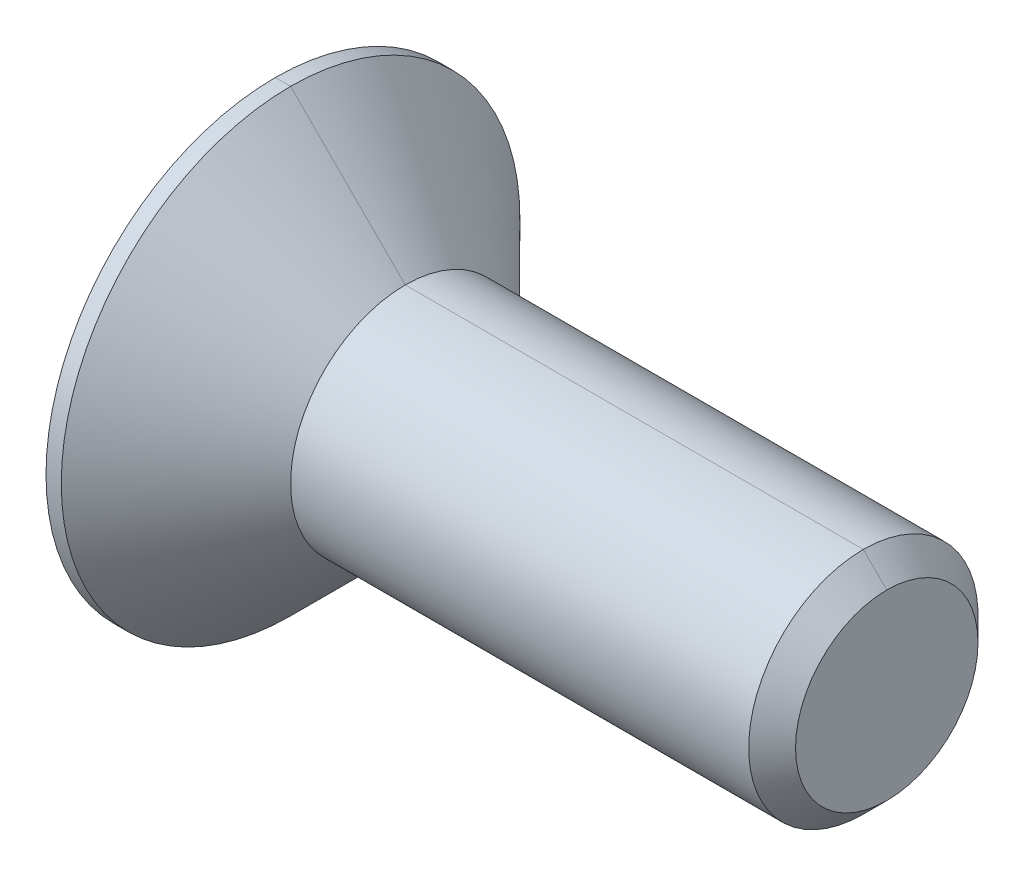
ISO-10303-21;
HEADER;
FILE_DESCRIPTION(('STEP AP214'),'2;1');
FILE_NAME('part.step','',(''),(''),'','','');
FILE_SCHEMA(('AUTOMOTIVE_DESIGN { 1 0 10303 214 1 1 1 1 }'));
ENDSEC;
DATA;
#1=APPLICATION_CONTEXT('core data for automotive mechanical design processes');
#2=APPLICATION_PROTOCOL_DEFINITION('international standard','automotive_design',2000,#1);
#3=PRODUCT_CONTEXT('',#1,'mechanical');
#4=PRODUCT('Part','Part','',(#3));
#5=PRODUCT_RELATED_PRODUCT_CATEGORY('part','',(#4));
#6=PRODUCT_DEFINITION_FORMATION('','',#4);
#7=PRODUCT_DEFINITION_CONTEXT('part definition',#1,'design');
#8=PRODUCT_DEFINITION('design','',#6,#7);
#9=PRODUCT_DEFINITION_SHAPE('','',#8);
#10=(LENGTH_UNIT() NAMED_UNIT(*) SI_UNIT(.MILLI.,.METRE.));
#11=(NAMED_UNIT(*) PLANE_ANGLE_UNIT() SI_UNIT($,.RADIAN.));
#12=(NAMED_UNIT(*) SI_UNIT($,.STERADIAN.) SOLID_ANGLE_UNIT());
#13=UNCERTAINTY_MEASURE_WITH_UNIT(LENGTH_MEASURE(1.E-05),#10,'distance_accuracy_value','');
#14=(GEOMETRIC_REPRESENTATION_CONTEXT(3) GLOBAL_UNCERTAINTY_ASSIGNED_CONTEXT((#13)) GLOBAL_UNIT_ASSIGNED_CONTEXT((#10,
#11,#12)) REPRESENTATION_CONTEXT('',''));
#15=CARTESIAN_POINT('',(0.,0.,0.));
#16=DIRECTION('',(0.,0.,1.));
#17=DIRECTION('',(1.,0.,0.));
#18=AXIS2_PLACEMENT_3D('',#15,#16,#17);
#19=CARTESIAN_POINT('',(1.4829016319,0.,0.));
#20=DIRECTION('',(-1.,0.,0.));
#21=DIRECTION('',(0.,1.,0.));
#22=AXIS2_PLACEMENT_3D('',#19,#20,#21);
#23=CONICAL_SURFACE('',#22,0.5099999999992,1.0471975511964);
#24=DIRECTION('',(0.499999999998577,-0.86602540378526,0.));
#25=VECTOR('',#24,1.);
#26=CARTESIAN_POINT('',(1.199999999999,0.9999999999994,0.));
#27=LINE('',#26,#25);
#28=CARTESIAN_POINT('',(1.199999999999,0.9999999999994,0.));
#29=VERTEX_POINT('',#28);
#30=CARTESIAN_POINT('',(1.777350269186,0.,0.));
#31=VERTEX_POINT('',#30);
#32=EDGE_CURVE('E23',#29,#31,#27,.T.);
#33=ORIENTED_EDGE('',*,*,#32,.F.);
#34=CARTESIAN_POINT('',(1.199999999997,0.,0.));
#35=DIRECTION('',(1.,0.,0.));
#36=DIRECTION('',(0.,0.500000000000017,-0.866025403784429));
#37=AXIS2_PLACEMENT_3D('',#34,#35,#36);
#38=CIRCLE('',#37,0.9999999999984);
#39=CARTESIAN_POINT('',(1.199999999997,0.4999999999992,-0.8660254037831));
#40=VERTEX_POINT('',#39);
#41=EDGE_CURVE('E258',#40,#29,#38,.T.);
#42=ORIENTED_EDGE('',*,*,#41,.F.);
#43=CARTESIAN_POINT('',(1.199999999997,0.,0.));
#44=DIRECTION('',(1.,0.,0.));
#45=DIRECTION('',(0.,-0.500000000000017,-0.866025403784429));
#46=AXIS2_PLACEMENT_3D('',#43,#44,#45);
#47=CIRCLE('',#46,0.9999999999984);
#48=CARTESIAN_POINT('',(1.199999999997,-0.4999999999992,-0.8660254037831));
#49=VERTEX_POINT('',#48);
#50=EDGE_CURVE('E242',#49,#40,#47,.T.);
#51=ORIENTED_EDGE('',*,*,#50,.F.);
#52=CARTESIAN_POINT('',(1.199999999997,0.,0.));
#53=DIRECTION('',(1.,0.,0.));
#54=DIRECTION('',(0.,-1.,0.));
#55=AXIS2_PLACEMENT_3D('',#52,#53,#54);
#56=CIRCLE('',#55,0.9999999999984);
#57=CARTESIAN_POINT('',(1.199999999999,-0.9999999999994,0.));
#58=VERTEX_POINT('',#57);
#59=EDGE_CURVE('E232',#58,#49,#56,.T.);
#60=ORIENTED_EDGE('',*,*,#59,.F.);
#61=DIRECTION('',(-0.499999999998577,-0.86602540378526,0.));
#62=VECTOR('',#61,1.);
#63=CARTESIAN_POINT('',(1.777350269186,0.,0.));
#64=LINE('',#63,#62);
#65=EDGE_CURVE('E10',#31,#58,#64,.T.);
#66=ORIENTED_EDGE('',*,*,#65,.F.);
#67=EDGE_LOOP('',(#33,#42,#51,#60,#66));
#68=FACE_BOUND('',#67,.T.);
#69=ADVANCED_FACE('F15',(#68),#23,.F.);
#70=CARTESIAN_POINT('',(1.4829016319,0.,0.));
#71=DIRECTION('',(-1.,0.,0.));
#72=DIRECTION('',(0.,1.,0.));
#73=AXIS2_PLACEMENT_3D('',#70,#71,#72);
#74=CONICAL_SURFACE('',#73,0.5099999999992,1.0471975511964);
#75=CARTESIAN_POINT('',(1.199999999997,0.,0.));
#76=DIRECTION('',(1.,0.,0.));
#77=DIRECTION('',(0.,-0.500000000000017,0.866025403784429));
#78=AXIS2_PLACEMENT_3D('',#75,#76,#77);
#79=CIRCLE('',#78,0.9999999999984);
#80=CARTESIAN_POINT('',(1.199999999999,-0.4999999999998,0.8660254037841));
#81=VERTEX_POINT('',#80);
#82=EDGE_CURVE('E166',#81,#58,#79,.T.);
#83=ORIENTED_EDGE('',*,*,#82,.F.);
#84=CARTESIAN_POINT('',(1.199999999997,0.,0.));
#85=DIRECTION('',(1.,0.,0.));
#86=DIRECTION('',(0.,0.500000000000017,0.866025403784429));
#87=AXIS2_PLACEMENT_3D('',#84,#85,#86);
#88=CIRCLE('',#87,0.9999999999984);
#89=CARTESIAN_POINT('',(1.199999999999,0.4999999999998,0.8660254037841));
#90=VERTEX_POINT('',#89);
#91=EDGE_CURVE('E216',#90,#81,#88,.T.);
#92=ORIENTED_EDGE('',*,*,#91,.F.);
#93=CARTESIAN_POINT('',(1.199999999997,0.,0.));
#94=DIRECTION('',(1.,0.,0.));
#95=DIRECTION('',(0.,1.,0.));
#96=AXIS2_PLACEMENT_3D('',#93,#94,#95);
#97=CIRCLE('',#96,0.9999999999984);
#98=EDGE_CURVE('E257',#29,#90,#97,.T.);
#99=ORIENTED_EDGE('',*,*,#98,.F.);
#100=ORIENTED_EDGE('',*,*,#32,.T.);
#101=ORIENTED_EDGE('',*,*,#65,.T.);
#102=EDGE_LOOP('',(#83,#92,#99,#100,#101));
#103=FACE_BOUND('',#102,.T.);
#104=ADVANCED_FACE('F404',(#103),#74,.F.);
#105=CARTESIAN_POINT('',(1.2,0.,0.));
#106=DIRECTION('',(-1.,0.,0.));
#107=DIRECTION('',(0.,0.,1.));
#108=AXIS2_PLACEMENT_3D('',#105,#106,#107);
#109=PLANE('',#108);
#110=DIRECTION('',(1.17608397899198E-12,0.866025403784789,-0.499999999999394));
#111=VECTOR('',#110,1.);
#112=CARTESIAN_POINT('',(1.199999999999,0.4999999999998,0.8660254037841));
#113=LINE('',#112,#111);
#114=CARTESIAN_POINT('',(1.2,1.,0.5773502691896));
#115=VERTEX_POINT('',#114);
#116=EDGE_CURVE('E208',#90,#115,#113,.T.);
#117=ORIENTED_EDGE('',*,*,#116,.T.);
#118=DIRECTION('',(1.881426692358E-12,1.085704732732E-12,1.));
#119=VECTOR('',#118,1.);
#120=CARTESIAN_POINT('',(1.199999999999,0.9999999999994,0.));
#121=LINE('',#120,#119);
#122=EDGE_CURVE('E255',#29,#115,#121,.T.);
#123=ORIENTED_EDGE('',*,*,#122,.F.);
#124=ORIENTED_EDGE('',*,*,#98,.T.);
#125=EDGE_LOOP('',(#117,#123,#124));
#126=FACE_BOUND('',#125,.T.);
#127=ADVANCED_FACE('F408',(#126),#109,.T.);
#128=CARTESIAN_POINT('',(1.2,1.,0.5773502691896));
#129=DIRECTION('',(0.,1.,0.));
#130=DIRECTION('',(1.,0.,0.));
#131=AXIS2_PLACEMENT_3D('',#128,#129,#130);
#132=PLANE('',#131);
#133=DIRECTION('',(1.,0.,0.));
#134=VECTOR('',#133,1.);
#135=CARTESIAN_POINT('',(0.,1.,0.5773502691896));
#136=LINE('',#135,#134);
#137=CARTESIAN_POINT('',(0.,1.,0.5773502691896));
#138=VERTEX_POINT('',#137);
#139=EDGE_CURVE('E201',#138,#115,#136,.T.);
#140=ORIENTED_EDGE('',*,*,#139,.F.);
#141=DIRECTION('',(0.,0.,-1.));
#142=VECTOR('',#141,1.);
#143=CARTESIAN_POINT('',(0.,1.,0.5773502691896));
#144=LINE('',#143,#142);
#145=CARTESIAN_POINT('',(0.,1.,-0.5773502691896));
#146=VERTEX_POINT('',#145);
#147=EDGE_CURVE('E274',#138,#146,#144,.T.);
#148=ORIENTED_EDGE('',*,*,#147,.T.);
#149=DIRECTION('',(1.,0.,0.));
#150=VECTOR('',#149,1.);
#151=CARTESIAN_POINT('',(0.,1.,-0.5773502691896));
#152=LINE('',#151,#150);
#153=CARTESIAN_POINT('',(1.2,1.,-0.5773502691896));
#154=VERTEX_POINT('',#153);
#155=EDGE_CURVE('E247',#146,#154,#152,.T.);
#156=ORIENTED_EDGE('',*,*,#155,.T.);
#157=DIRECTION('',(-1.881426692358E-12,-1.086089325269E-12,1.));
#158=VECTOR('',#157,1.);
#159=CARTESIAN_POINT('',(1.2,1.,-0.5773502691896));
#160=LINE('',#159,#158);
#161=EDGE_CURVE('E254',#154,#29,#160,.T.);
#162=ORIENTED_EDGE('',*,*,#161,.T.);
#163=ORIENTED_EDGE('',*,*,#122,.T.);
#164=EDGE_LOOP('',(#140,#148,#156,#162,#163));
#165=FACE_BOUND('',#164,.T.);
#166=ADVANCED_FACE('F414',(#165),#132,.F.);
#167=CARTESIAN_POINT('',(1.2,0.,0.));
#168=DIRECTION('',(-1.,0.,0.));
#169=DIRECTION('',(0.,0.,1.));
#170=AXIS2_PLACEMENT_3D('',#167,#168,#169);
#171=PLANE('',#170);
#172=ORIENTED_EDGE('',*,*,#161,.F.);
#173=DIRECTION('',(-1.17569938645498E-12,-0.866025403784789,-0.499999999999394));
#174=VECTOR('',#173,1.);
#175=CARTESIAN_POINT('',(1.2,1.,-0.5773502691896));
#176=LINE('',#175,#174);
#177=EDGE_CURVE('E251',#154,#40,#176,.T.);
#178=ORIENTED_EDGE('',*,*,#177,.T.);
#179=ORIENTED_EDGE('',*,*,#41,.T.);
#180=EDGE_LOOP('',(#172,#178,#179));
#181=FACE_BOUND('',#180,.T.);
#182=ADVANCED_FACE('F624',(#181),#171,.T.);
#183=CARTESIAN_POINT('',(1.2,1.,-0.5773502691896));
#184=DIRECTION('',(0.,0.500000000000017,-0.866025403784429));
#185=DIRECTION('',(-1.,0.,0.));
#186=AXIS2_PLACEMENT_3D('',#183,#184,#185);
#187=PLANE('',#186);
#188=ORIENTED_EDGE('',*,*,#155,.F.);
#189=DIRECTION('',(0.,0.866025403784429,0.500000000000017));
#190=VECTOR('',#189,1.);
#191=CARTESIAN_POINT('',(0.,0.,-1.154700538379));
#192=LINE('',#191,#190);
#193=CARTESIAN_POINT('',(0.,0.,-1.154700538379));
#194=VERTEX_POINT('',#193);
#195=EDGE_CURVE('E178',#194,#146,#192,.T.);
#196=ORIENTED_EDGE('',*,*,#195,.F.);
#197=DIRECTION('',(1.,0.,0.));
#198=VECTOR('',#197,1.);
#199=CARTESIAN_POINT('',(0.,0.,-1.154700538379));
#200=LINE('',#199,#198);
#201=CARTESIAN_POINT('',(1.2,0.,-1.154700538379));
#202=VERTEX_POINT('',#201);
#203=EDGE_CURVE('E173',#194,#202,#200,.T.);
#204=ORIENTED_EDGE('',*,*,#203,.T.);
#205=DIRECTION('',(1.17608397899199E-12,-0.866025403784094,-0.500000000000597));
#206=VECTOR('',#205,1.);
#207=CARTESIAN_POINT('',(1.199999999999,0.4999999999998,-0.8660254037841));
#208=LINE('',#207,#206);
#209=EDGE_CURVE('E246',#40,#202,#208,.T.);
#210=ORIENTED_EDGE('',*,*,#209,.F.);
#211=ORIENTED_EDGE('',*,*,#177,.F.);
#212=EDGE_LOOP('',(#188,#196,#204,#210,#211));
#213=FACE_BOUND('',#212,.T.);
#214=ADVANCED_FACE('F612',(#213),#187,.F.);
#215=CARTESIAN_POINT('',(1.2,0.,0.));
#216=DIRECTION('',(-1.,0.,0.));
#217=DIRECTION('',(0.,0.,1.));
#218=AXIS2_PLACEMENT_3D('',#215,#216,#217);
#219=PLANE('',#218);
#220=ORIENTED_EDGE('',*,*,#50,.T.);
#221=ORIENTED_EDGE('',*,*,#209,.T.);
#222=DIRECTION('',(-1.17569938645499E-12,-0.866025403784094,0.500000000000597));
#223=VECTOR('',#222,1.);
#224=CARTESIAN_POINT('',(1.2,0.,-1.154700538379));
#225=LINE('',#224,#223);
#226=EDGE_CURVE('E238',#202,#49,#225,.T.);
#227=ORIENTED_EDGE('',*,*,#226,.T.);
#228=EDGE_LOOP('',(#220,#221,#227));
#229=FACE_BOUND('',#228,.T.);
#230=ADVANCED_FACE('F601',(#229),#219,.T.);
#231=CARTESIAN_POINT('',(1.2,0.,-1.154700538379));
#232=DIRECTION('',(0.,-0.500000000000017,-0.866025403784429));
#233=DIRECTION('',(0.,-0.866025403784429,0.500000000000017));
#234=AXIS2_PLACEMENT_3D('',#231,#232,#233);
#235=PLANE('',#234);
#236=ORIENTED_EDGE('',*,*,#203,.F.);
#237=DIRECTION('',(0.,0.866025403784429,-0.500000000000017));
#238=VECTOR('',#237,1.);
#239=CARTESIAN_POINT('',(0.,-1.,-0.5773502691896));
#240=LINE('',#239,#238);
#241=CARTESIAN_POINT('',(0.,-1.,-0.5773502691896));
#242=VERTEX_POINT('',#241);
#243=EDGE_CURVE('E169',#242,#194,#240,.T.);
#244=ORIENTED_EDGE('',*,*,#243,.F.);
#245=DIRECTION('',(1.,0.,0.));
#246=VECTOR('',#245,1.);
#247=CARTESIAN_POINT('',(0.,-1.,-0.5773502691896));
#248=LINE('',#247,#246);
#249=CARTESIAN_POINT('',(1.2,-1.,-0.5773502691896));
#250=VERTEX_POINT('',#249);
#251=EDGE_CURVE('E153',#242,#250,#248,.T.);
#252=ORIENTED_EDGE('',*,*,#251,.T.);
#253=DIRECTION('',(1.17608397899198E-12,-0.866025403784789,0.499999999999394));
#254=VECTOR('',#253,1.);
#255=CARTESIAN_POINT('',(1.199999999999,-0.4999999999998,-0.8660254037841));
#256=LINE('',#255,#254);
#257=EDGE_CURVE('E204',#49,#250,#256,.T.);
#258=ORIENTED_EDGE('',*,*,#257,.F.);
#259=ORIENTED_EDGE('',*,*,#226,.F.);
#260=EDGE_LOOP('',(#236,#244,#252,#258,#259));
#261=FACE_BOUND('',#260,.T.);
#262=ADVANCED_FACE('F170',(#261),#235,.F.);
#263=CARTESIAN_POINT('',(1.2,0.,0.));
#264=DIRECTION('',(-1.,0.,0.));
#265=DIRECTION('',(0.,0.,1.));
#266=AXIS2_PLACEMENT_3D('',#263,#264,#265);
#267=PLANE('',#266);
#268=ORIENTED_EDGE('',*,*,#257,.T.);
#269=DIRECTION('',(1.881426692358E-12,-1.085704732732E-12,-1.));
#270=VECTOR('',#269,1.);
#271=CARTESIAN_POINT('',(1.199999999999,-0.9999999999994,0.));
#272=LINE('',#271,#270);
#273=EDGE_CURVE('E162',#58,#250,#272,.T.);
#274=ORIENTED_EDGE('',*,*,#273,.F.);
#275=ORIENTED_EDGE('',*,*,#59,.T.);
#276=EDGE_LOOP('',(#268,#274,#275));
#277=FACE_BOUND('',#276,.T.);
#278=ADVANCED_FACE('F427',(#277),#267,.T.);
#279=CARTESIAN_POINT('',(1.2,-1.,-0.5773502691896));
#280=DIRECTION('',(0.,-1.,0.));
#281=DIRECTION('',(0.,0.,-1.));
#282=AXIS2_PLACEMENT_3D('',#279,#280,#281);
#283=PLANE('',#282);
#284=ORIENTED_EDGE('',*,*,#251,.F.);
#285=DIRECTION('',(0.,0.,1.));
#286=VECTOR('',#285,1.);
#287=CARTESIAN_POINT('',(0.,-1.,-0.5773502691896));
#288=LINE('',#287,#286);
#289=CARTESIAN_POINT('',(0.,-1.,0.5773502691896));
#290=VERTEX_POINT('',#289);
#291=EDGE_CURVE('E158',#242,#290,#288,.T.);
#292=ORIENTED_EDGE('',*,*,#291,.T.);
#293=DIRECTION('',(1.,0.,0.));
#294=VECTOR('',#293,1.);
#295=CARTESIAN_POINT('',(0.,-1.,0.5773502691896));
#296=LINE('',#295,#294);
#297=CARTESIAN_POINT('',(1.2,-1.,0.5773502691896));
#298=VERTEX_POINT('',#297);
#299=EDGE_CURVE('E220',#290,#298,#296,.T.);
#300=ORIENTED_EDGE('',*,*,#299,.T.);
#301=DIRECTION('',(-1.881426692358E-12,1.086089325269E-12,-1.));
#302=VECTOR('',#301,1.);
#303=CARTESIAN_POINT('',(1.2,-1.,0.5773502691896));
#304=LINE('',#303,#302);
#305=EDGE_CURVE('E227',#298,#58,#304,.T.);
#306=ORIENTED_EDGE('',*,*,#305,.T.);
#307=ORIENTED_EDGE('',*,*,#273,.T.);
#308=EDGE_LOOP('',(#284,#292,#300,#306,#307));
#309=FACE_BOUND('',#308,.T.);
#310=ADVANCED_FACE('F155',(#309),#283,.F.);
#311=CARTESIAN_POINT('',(1.2,0.,0.));
#312=DIRECTION('',(-1.,0.,0.));
#313=DIRECTION('',(0.,0.,1.));
#314=AXIS2_PLACEMENT_3D('',#311,#312,#313);
#315=PLANE('',#314);
#316=ORIENTED_EDGE('',*,*,#305,.F.);
#317=DIRECTION('',(-1.17569938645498E-12,0.866025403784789,0.499999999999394));
#318=VECTOR('',#317,1.);
#319=CARTESIAN_POINT('',(1.2,-1.,0.5773502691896));
#320=LINE('',#319,#318);
#321=EDGE_CURVE('E223',#298,#81,#320,.T.);
#322=ORIENTED_EDGE('',*,*,#321,.T.);
#323=ORIENTED_EDGE('',*,*,#82,.T.);
#324=EDGE_LOOP('',(#316,#322,#323));
#325=FACE_BOUND('',#324,.T.);
#326=ADVANCED_FACE('F426',(#325),#315,.T.);
#327=CARTESIAN_POINT('',(1.2,-1.,0.5773502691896));
#328=DIRECTION('',(0.,-0.500000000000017,0.866025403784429));
#329=DIRECTION('',(-1.,0.,0.));
#330=AXIS2_PLACEMENT_3D('',#327,#328,#329);
#331=PLANE('',#330);
#332=ORIENTED_EDGE('',*,*,#299,.F.);
#333=DIRECTION('',(0.,-0.866025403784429,-0.500000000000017));
#334=VECTOR('',#333,1.);
#335=CARTESIAN_POINT('',(0.,0.,1.154700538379));
#336=LINE('',#335,#334);
#337=CARTESIAN_POINT('',(0.,0.,1.154700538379));
#338=VERTEX_POINT('',#337);
#339=EDGE_CURVE('E185',#338,#290,#336,.T.);
#340=ORIENTED_EDGE('',*,*,#339,.F.);
#341=DIRECTION('',(1.,0.,0.));
#342=VECTOR('',#341,1.);
#343=CARTESIAN_POINT('',(0.,0.,1.154700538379));
#344=LINE('',#343,#342);
#345=CARTESIAN_POINT('',(1.2,0.,1.154700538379));
#346=VERTEX_POINT('',#345);
#347=EDGE_CURVE('E197',#338,#346,#344,.T.);
#348=ORIENTED_EDGE('',*,*,#347,.T.);
#349=DIRECTION('',(1.17608397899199E-12,0.866025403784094,0.500000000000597));
#350=VECTOR('',#349,1.);
#351=CARTESIAN_POINT('',(1.199999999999,-0.4999999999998,0.8660254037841));
#352=LINE('',#351,#350);
#353=EDGE_CURVE('E213',#81,#346,#352,.T.);
#354=ORIENTED_EDGE('',*,*,#353,.F.);
#355=ORIENTED_EDGE('',*,*,#321,.F.);
#356=EDGE_LOOP('',(#332,#340,#348,#354,#355));
#357=FACE_BOUND('',#356,.T.);
#358=ADVANCED_FACE('F432',(#357),#331,.F.);
#359=CARTESIAN_POINT('',(1.2,0.,0.));
#360=DIRECTION('',(-1.,0.,0.));
#361=DIRECTION('',(0.,0.,1.));
#362=AXIS2_PLACEMENT_3D('',#359,#360,#361);
#363=PLANE('',#362);
#364=ORIENTED_EDGE('',*,*,#353,.T.);
#365=DIRECTION('',(-1.17569938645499E-12,0.866025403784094,-0.500000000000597));
#366=VECTOR('',#365,1.);
#367=CARTESIAN_POINT('',(1.2,0.,1.154700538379));
#368=LINE('',#367,#366);
#369=EDGE_CURVE('E212',#346,#90,#368,.T.);
#370=ORIENTED_EDGE('',*,*,#369,.T.);
#371=ORIENTED_EDGE('',*,*,#91,.T.);
#372=EDGE_LOOP('',(#364,#370,#371));
#373=FACE_BOUND('',#372,.T.);
#374=ADVANCED_FACE('F398',(#373),#363,.T.);
#375=CARTESIAN_POINT('',(1.2,0.,1.154700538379));
#376=DIRECTION('',(0.,0.500000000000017,0.866025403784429));
#377=DIRECTION('',(1.,0.,0.));
#378=AXIS2_PLACEMENT_3D('',#375,#376,#377);
#379=PLANE('',#378);
#380=ORIENTED_EDGE('',*,*,#347,.F.);
#381=DIRECTION('',(0.,-0.866025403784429,0.500000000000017));
#382=VECTOR('',#381,1.);
#383=CARTESIAN_POINT('',(0.,1.,0.5773502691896));
#384=LINE('',#383,#382);
#385=EDGE_CURVE('E191',#138,#338,#384,.T.);
#386=ORIENTED_EDGE('',*,*,#385,.F.);
#387=ORIENTED_EDGE('',*,*,#139,.T.);
#388=ORIENTED_EDGE('',*,*,#116,.F.);
#389=ORIENTED_EDGE('',*,*,#369,.F.);
#390=EDGE_LOOP('',(#380,#386,#387,#388,#389));
#391=FACE_BOUND('',#390,.T.);
#392=ADVANCED_FACE('F390',(#391),#379,.F.);
#393=CARTESIAN_POINT('',(0.,0.,-1.));
#394=DIRECTION('',(1.,0.,0.));
#395=DIRECTION('',(0.,1.,0.));
#396=AXIS2_PLACEMENT_3D('',#393,#394,#395);
#397=PLANE('',#396);
#398=ORIENTED_EDGE('',*,*,#147,.F.);
#399=ORIENTED_EDGE('',*,*,#385,.T.);
#400=ORIENTED_EDGE('',*,*,#339,.T.);
#401=ORIENTED_EDGE('',*,*,#291,.F.);
#402=ORIENTED_EDGE('',*,*,#243,.T.);
#403=ORIENTED_EDGE('',*,*,#195,.T.);
#404=EDGE_LOOP('',(#398,#399,#400,#401,#402,#403));
#405=FACE_BOUND('',#404,.T.);
#406=CARTESIAN_POINT('',(0.,0.,0.));
#407=DIRECTION('',(-1.,0.,0.));
#408=DIRECTION('',(0.,-1.,0.));
#409=AXIS2_PLACEMENT_3D('',#406,#407,#408);
#410=CIRCLE('',#409,3.);
#411=CARTESIAN_POINT('',(0.,-3.,0.));
#412=VERTEX_POINT('',#411);
#413=CARTESIAN_POINT('',(0.,3.,0.));
#414=VERTEX_POINT('',#413);
#415=EDGE_CURVE('E286',#412,#414,#410,.T.);
#416=ORIENTED_EDGE('',*,*,#415,.T.);
#417=CARTESIAN_POINT('',(0.,0.,0.));
#418=DIRECTION('',(-1.,0.,0.));
#419=DIRECTION('',(0.,1.,0.));
#420=AXIS2_PLACEMENT_3D('',#417,#418,#419);
#421=CIRCLE('',#420,3.);
#422=EDGE_CURVE('E278',#414,#412,#421,.T.);
#423=ORIENTED_EDGE('',*,*,#422,.T.);
#424=EDGE_LOOP('',(#416,#423));
#425=FACE_BOUND('',#424,.T.);
#426=ADVANCED_FACE('F181',(#405,#425),#397,.F.);
#427=CARTESIAN_POINT('',(8.,0.,0.));
#428=DIRECTION('',(-1.,0.,0.));
#429=DIRECTION('',(0.,-1.,0.));
#430=AXIS2_PLACEMENT_3D('',#427,#428,#429);
#431=CYLINDRICAL_SURFACE('',#430,3.);
#432=ORIENTED_EDGE('',*,*,#422,.F.);
#433=DIRECTION('',(-1.,0.,0.));
#434=VECTOR('',#433,1.);
#435=CARTESIAN_POINT('',(0.2,3.,0.));
#436=LINE('',#435,#434);
#437=CARTESIAN_POINT('',(0.2,3.,0.));
#438=VERTEX_POINT('',#437);
#439=EDGE_CURVE('E293',#438,#414,#436,.T.);
#440=ORIENTED_EDGE('',*,*,#439,.F.);
#441=CARTESIAN_POINT('',(0.2,0.,0.));
#442=DIRECTION('',(1.,0.,0.));
#443=DIRECTION('',(0.,-1.,0.));
#444=AXIS2_PLACEMENT_3D('',#441,#442,#443);
#445=CIRCLE('',#444,3.);
#446=CARTESIAN_POINT('',(0.2,-3.,0.));
#447=VERTEX_POINT('',#446);
#448=EDGE_CURVE('E301',#447,#438,#445,.T.);
#449=ORIENTED_EDGE('',*,*,#448,.F.);
#450=DIRECTION('',(1.,0.,0.));
#451=VECTOR('',#450,1.);
#452=CARTESIAN_POINT('',(0.,-3.,0.));
#453=LINE('',#452,#451);
#454=EDGE_CURVE('E283',#412,#447,#453,.T.);
#455=ORIENTED_EDGE('',*,*,#454,.F.);
#456=EDGE_LOOP('',(#432,#440,#449,#455));
#457=FACE_BOUND('',#456,.T.);
#458=ADVANCED_FACE('F385',(#457),#431,.T.);
#459=CARTESIAN_POINT('',(8.,0.,0.));
#460=DIRECTION('',(-1.,0.,0.));
#461=DIRECTION('',(0.,-1.,0.));
#462=AXIS2_PLACEMENT_3D('',#459,#460,#461);
#463=CYLINDRICAL_SURFACE('',#462,3.);
#464=CARTESIAN_POINT('',(0.2,0.,0.));
#465=DIRECTION('',(1.,0.,0.));
#466=DIRECTION('',(0.,1.,0.));
#467=AXIS2_PLACEMENT_3D('',#464,#465,#466);
#468=CIRCLE('',#467,3.);
#469=EDGE_CURVE('E294',#438,#447,#468,.T.);
#470=ORIENTED_EDGE('',*,*,#469,.F.);
#471=ORIENTED_EDGE('',*,*,#439,.T.);
#472=ORIENTED_EDGE('',*,*,#415,.F.);
#473=ORIENTED_EDGE('',*,*,#454,.T.);
#474=EDGE_LOOP('',(#470,#471,#472,#473));
#475=FACE_BOUND('',#474,.T.);
#476=ADVANCED_FACE('F388',(#475),#463,.T.);
#477=CARTESIAN_POINT('',(0.95,0.,0.));
#478=DIRECTION('',(-1.,0.,0.));
#479=DIRECTION('',(0.,1.,0.));
#480=AXIS2_PLACEMENT_3D('',#477,#478,#479);
#481=CONICAL_SURFACE('',#480,2.25,0.785398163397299);
#482=ORIENTED_EDGE('',*,*,#469,.T.);
#483=DIRECTION('',(0.707106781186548,0.707106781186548,0.));
#484=VECTOR('',#483,1.);
#485=CARTESIAN_POINT('',(0.2,-3.,0.));
#486=LINE('',#485,#484);
#487=CARTESIAN_POINT('',(1.7,-1.5,0.));
#488=VERTEX_POINT('',#487);
#489=EDGE_CURVE('E305',#447,#488,#486,.T.);
#490=ORIENTED_EDGE('',*,*,#489,.T.);
#491=CARTESIAN_POINT('',(1.7,0.,0.));
#492=DIRECTION('',(-1.,0.,0.));
#493=DIRECTION('',(0.,-1.,0.));
#494=AXIS2_PLACEMENT_3D('',#491,#492,#493);
#495=CIRCLE('',#494,1.5);
#496=CARTESIAN_POINT('',(1.7,1.5,0.));
#497=VERTEX_POINT('',#496);
#498=EDGE_CURVE('E312',#488,#497,#495,.T.);
#499=ORIENTED_EDGE('',*,*,#498,.T.);
#500=DIRECTION('',(-0.707106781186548,0.707106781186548,0.));
#501=VECTOR('',#500,1.);
#502=CARTESIAN_POINT('',(1.7,1.5,0.));
#503=LINE('',#502,#501);
#504=EDGE_CURVE('E298',#497,#438,#503,.T.);
#505=ORIENTED_EDGE('',*,*,#504,.T.);
#506=EDGE_LOOP('',(#482,#490,#499,#505));
#507=FACE_BOUND('',#506,.T.);
#508=ADVANCED_FACE('F377',(#507),#481,.T.);
#509=CARTESIAN_POINT('',(0.95,0.,0.));
#510=DIRECTION('',(-1.,0.,0.));
#511=DIRECTION('',(0.,1.,0.));
#512=AXIS2_PLACEMENT_3D('',#509,#510,#511);
#513=CONICAL_SURFACE('',#512,2.25,0.785398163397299);
#514=CARTESIAN_POINT('',(1.7,0.,0.));
#515=DIRECTION('',(-1.,0.,0.));
#516=DIRECTION('',(0.,1.,0.));
#517=AXIS2_PLACEMENT_3D('',#514,#515,#516);
#518=CIRCLE('',#517,1.5);
#519=EDGE_CURVE('E308',#497,#488,#518,.T.);
#520=ORIENTED_EDGE('',*,*,#519,.T.);
#521=ORIENTED_EDGE('',*,*,#489,.F.);
#522=ORIENTED_EDGE('',*,*,#448,.T.);
#523=ORIENTED_EDGE('',*,*,#504,.F.);
#524=EDGE_LOOP('',(#520,#521,#522,#523));
#525=FACE_BOUND('',#524,.T.);
#526=ADVANCED_FACE('F382',(#525),#513,.T.);
#527=CARTESIAN_POINT('',(8.,0.,0.));
#528=DIRECTION('',(-1.,0.,0.));
#529=DIRECTION('',(0.,-1.,0.));
#530=AXIS2_PLACEMENT_3D('',#527,#528,#529);
#531=CYLINDRICAL_SURFACE('',#530,1.5);
#532=ORIENTED_EDGE('',*,*,#519,.F.);
#533=DIRECTION('',(-1.,0.,0.));
#534=VECTOR('',#533,1.);
#535=CARTESIAN_POINT('',(7.6935,1.5,0.));
#536=LINE('',#535,#534);
#537=CARTESIAN_POINT('',(7.6935,1.5,0.));
#538=VERTEX_POINT('',#537);
#539=EDGE_CURVE('E316',#538,#497,#536,.T.);
#540=ORIENTED_EDGE('',*,*,#539,.F.);
#541=CARTESIAN_POINT('',(7.6935,0.,0.));
#542=DIRECTION('',(1.,0.,0.));
#543=DIRECTION('',(0.,-1.,0.));
#544=AXIS2_PLACEMENT_3D('',#541,#542,#543);
#545=CIRCLE('',#544,1.5);
#546=CARTESIAN_POINT('',(7.6935,-1.5,0.));
#547=VERTEX_POINT('',#546);
#548=EDGE_CURVE('E333',#547,#538,#545,.T.);
#549=ORIENTED_EDGE('',*,*,#548,.F.);
#550=DIRECTION('',(1.,0.,0.));
#551=VECTOR('',#550,1.);
#552=CARTESIAN_POINT('',(1.7,-1.5,0.));
#553=LINE('',#552,#551);
#554=EDGE_CURVE('E309',#488,#547,#553,.T.);
#555=ORIENTED_EDGE('',*,*,#554,.F.);
#556=EDGE_LOOP('',(#532,#540,#549,#555));
#557=FACE_BOUND('',#556,.T.);
#558=ADVANCED_FACE('F372',(#557),#531,.T.);
#559=CARTESIAN_POINT('',(8.,0.,0.));
#560=DIRECTION('',(-1.,0.,0.));
#561=DIRECTION('',(0.,-1.,0.));
#562=AXIS2_PLACEMENT_3D('',#559,#560,#561);
#563=CYLINDRICAL_SURFACE('',#562,1.5);
#564=CARTESIAN_POINT('',(7.6935,0.,0.));
#565=DIRECTION('',(1.,0.,0.));
#566=DIRECTION('',(0.,1.,0.));
#567=AXIS2_PLACEMENT_3D('',#564,#565,#566);
#568=CIRCLE('',#567,1.5);
#569=EDGE_CURVE('E320',#538,#547,#568,.T.);
#570=ORIENTED_EDGE('',*,*,#569,.F.);
#571=ORIENTED_EDGE('',*,*,#539,.T.);
#572=ORIENTED_EDGE('',*,*,#498,.F.);
#573=ORIENTED_EDGE('',*,*,#554,.T.);
#574=EDGE_LOOP('',(#570,#571,#572,#573));
#575=FACE_BOUND('',#574,.T.);
#576=ADVANCED_FACE('F375',(#575),#563,.T.);
#577=CARTESIAN_POINT('',(7.84675,0.,0.));
#578=DIRECTION('',(-1.,0.,0.));
#579=DIRECTION('',(0.,1.,0.));
#580=AXIS2_PLACEMENT_3D('',#577,#578,#579);
#581=CONICAL_SURFACE('',#580,1.34675,0.785398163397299);
#582=ORIENTED_EDGE('',*,*,#569,.T.);
#583=DIRECTION('',(0.707106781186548,0.707106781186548,0.));
#584=VECTOR('',#583,1.);
#585=CARTESIAN_POINT('',(7.6935,-1.5,0.));
#586=LINE('',#585,#584);
#587=CARTESIAN_POINT('',(8.,-1.1935,0.));
#588=VERTEX_POINT('',#587);
#589=EDGE_CURVE('E334',#547,#588,#586,.T.);
#590=ORIENTED_EDGE('',*,*,#589,.T.);
#591=CARTESIAN_POINT('',(8.,0.,0.));
#592=DIRECTION('',(1.,0.,0.));
#593=DIRECTION('',(0.,1.,0.));
#594=AXIS2_PLACEMENT_3D('',#591,#592,#593);
#595=CIRCLE('',#594,1.1935);
#596=CARTESIAN_POINT('',(8.,1.1935,0.));
#597=VERTEX_POINT('',#596);
#598=EDGE_CURVE('E347',#597,#588,#595,.T.);
#599=ORIENTED_EDGE('',*,*,#598,.F.);
#600=DIRECTION('',(-0.707106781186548,0.707106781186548,0.));
#601=VECTOR('',#600,1.);
#602=CARTESIAN_POINT('',(8.,1.1935,0.));
#603=LINE('',#602,#601);
#604=EDGE_CURVE('E323',#597,#538,#603,.T.);
#605=ORIENTED_EDGE('',*,*,#604,.T.);
#606=EDGE_LOOP('',(#582,#590,#599,#605));
#607=FACE_BOUND('',#606,.T.);
#608=ADVANCED_FACE('F363',(#607),#581,.T.);
#609=CARTESIAN_POINT('',(7.84675,0.,0.));
#610=DIRECTION('',(-1.,0.,0.));
#611=DIRECTION('',(0.,1.,0.));
#612=AXIS2_PLACEMENT_3D('',#609,#610,#611);
#613=CONICAL_SURFACE('',#612,1.34675,0.785398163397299);
#614=CARTESIAN_POINT('',(8.,0.,0.));
#615=DIRECTION('',(1.,0.,0.));
#616=DIRECTION('',(0.,-1.,0.));
#617=AXIS2_PLACEMENT_3D('',#614,#615,#616);
#618=CIRCLE('',#617,1.1935);
#619=EDGE_CURVE('E337',#588,#597,#618,.T.);
#620=ORIENTED_EDGE('',*,*,#619,.F.);
#621=ORIENTED_EDGE('',*,*,#589,.F.);
#622=ORIENTED_EDGE('',*,*,#548,.T.);
#623=ORIENTED_EDGE('',*,*,#604,.F.);
#624=EDGE_LOOP('',(#620,#621,#622,#623));
#625=FACE_BOUND('',#624,.T.);
#626=ADVANCED_FACE('F368',(#625),#613,.T.);
#627=CARTESIAN_POINT('',(8.,0.,-1.1935));
#628=DIRECTION('',(-1.,0.,0.));
#629=DIRECTION('',(0.,0.,1.));
#630=AXIS2_PLACEMENT_3D('',#627,#628,#629);
#631=PLANE('',#630);
#632=ORIENTED_EDGE('',*,*,#598,.T.);
#633=ORIENTED_EDGE('',*,*,#619,.T.);
#634=EDGE_LOOP('',(#632,#633));
#635=FACE_BOUND('',#634,.T.);
#636=ADVANCED_FACE('F360',(#635),#631,.F.);
#637=CLOSED_SHELL('',(#69,#104,#127,#166,#182,#214,#230,#262,#278,#310,#326,#358,#374,#392,#426,
#458,#476,#508,#526,#558,#576,#608,#626,#636));
#638=MANIFOLD_SOLID_BREP('B1',#637);
#639=ADVANCED_BREP_SHAPE_REPRESENTATION('',(#18,#638),#14);
#640=SHAPE_DEFINITION_REPRESENTATION(#9,#639);
ENDSEC;
END-ISO-10303-21;
